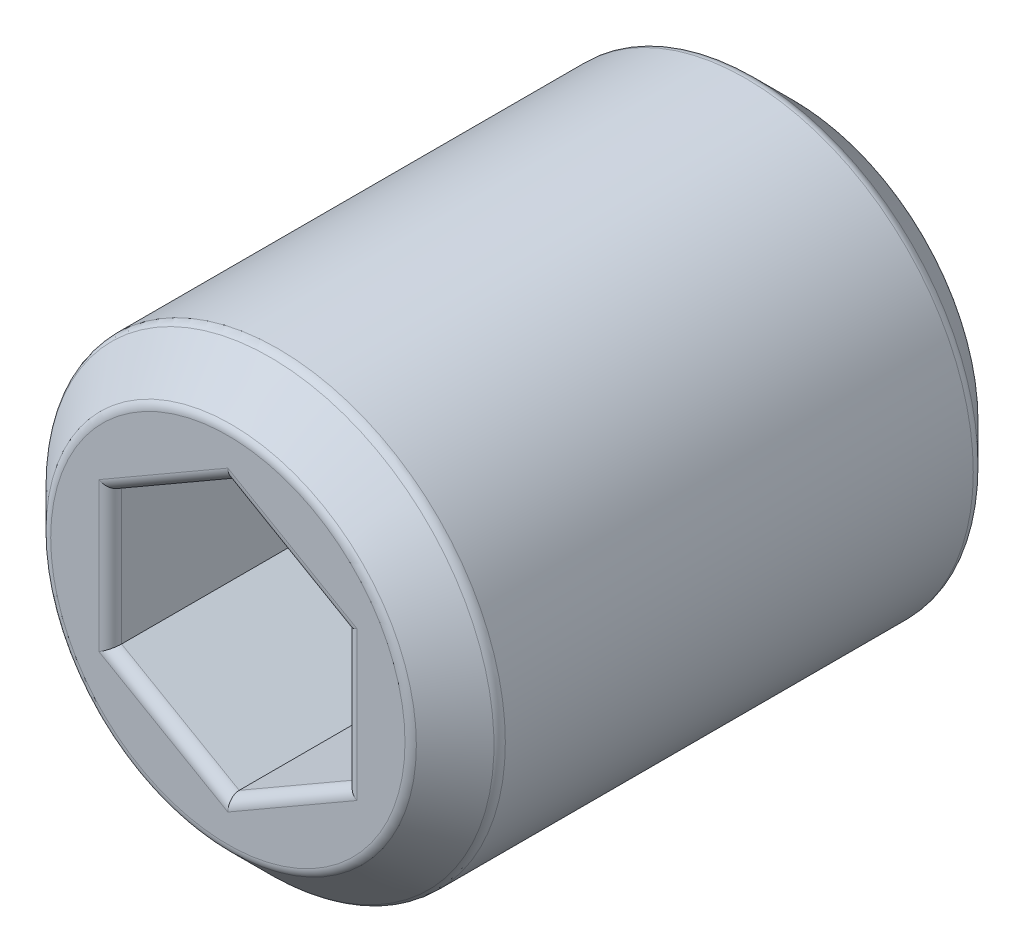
ISO-10303-21;
HEADER;
FILE_DESCRIPTION(('STEP AP214'),'2;1');
FILE_NAME('part.step','',(''),(''),'','','');
FILE_SCHEMA(('AUTOMOTIVE_DESIGN { 1 0 10303 214 1 1 1 1 }'));
ENDSEC;
DATA;
#1=APPLICATION_CONTEXT('core data for automotive mechanical design processes');
#2=APPLICATION_PROTOCOL_DEFINITION('international standard','automotive_design',2000,#1);
#3=PRODUCT_CONTEXT('',#1,'mechanical');
#4=PRODUCT('Part','Part','',(#3));
#5=PRODUCT_RELATED_PRODUCT_CATEGORY('part','',(#4));
#6=PRODUCT_DEFINITION_FORMATION('','',#4);
#7=PRODUCT_DEFINITION_CONTEXT('part definition',#1,'design');
#8=PRODUCT_DEFINITION('design','',#6,#7);
#9=PRODUCT_DEFINITION_SHAPE('','',#8);
#10=(LENGTH_UNIT() NAMED_UNIT(*) SI_UNIT(.MILLI.,.METRE.));
#11=(NAMED_UNIT(*) PLANE_ANGLE_UNIT() SI_UNIT($,.RADIAN.));
#12=(NAMED_UNIT(*) SI_UNIT($,.STERADIAN.) SOLID_ANGLE_UNIT());
#13=UNCERTAINTY_MEASURE_WITH_UNIT(LENGTH_MEASURE(1.E-05),#10,'distance_accuracy_value','');
#14=(GEOMETRIC_REPRESENTATION_CONTEXT(3) GLOBAL_UNCERTAINTY_ASSIGNED_CONTEXT((#13)) GLOBAL_UNIT_ASSIGNED_CONTEXT((#10,
#11,#12)) REPRESENTATION_CONTEXT('',''));
#15=CARTESIAN_POINT('',(0.,0.,0.));
#16=DIRECTION('',(0.,0.,1.));
#17=DIRECTION('',(1.,0.,0.));
#18=AXIS2_PLACEMENT_3D('',#15,#16,#17);
#19=CARTESIAN_POINT('',(0.,0.,5.));
#20=DIRECTION('',(0.,0.,-1.));
#21=DIRECTION('',(-1.,0.,0.));
#22=AXIS2_PLACEMENT_3D('',#19,#20,#21);
#23=CYLINDRICAL_SURFACE('',#22,2.);
#24=CARTESIAN_POINT('',(0.,0.,4.55857864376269));
#25=DIRECTION('',(0.,0.,1.));
#26=DIRECTION('',(1.,0.,0.));
#27=AXIS2_PLACEMENT_3D('',#24,#25,#26);
#28=CIRCLE('',#27,2.);
#29=CARTESIAN_POINT('',(2.,0.,4.55857864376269));
#30=VERTEX_POINT('',#29);
#31=EDGE_CURVE('E11',#30,#30,#28,.F.);
#32=ORIENTED_EDGE('',*,*,#31,.T.);
#33=EDGE_LOOP('',(#32));
#34=FACE_BOUND('',#33,.T.);
#35=CARTESIAN_POINT('',(0.,0.,0.44142135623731));
#36=DIRECTION('',(0.,0.,-1.));
#37=DIRECTION('',(-1.,0.,0.));
#38=AXIS2_PLACEMENT_3D('',#35,#36,#37);
#39=CIRCLE('',#38,2.);
#40=CARTESIAN_POINT('',(-2.,0.,0.44142135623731));
#41=VERTEX_POINT('',#40);
#42=EDGE_CURVE('E39',#41,#41,#39,.F.);
#43=ORIENTED_EDGE('',*,*,#42,.T.);
#44=EDGE_LOOP('',(#43));
#45=FACE_BOUND('',#44,.T.);
#46=ADVANCED_FACE('F32',(#34,#45),#23,.T.);
#47=CARTESIAN_POINT('',(0.,0.,5.));
#48=DIRECTION('',(0.,0.,1.));
#49=DIRECTION('',(1.,0.,0.));
#50=AXIS2_PLACEMENT_3D('',#47,#48,#49);
#51=PLANE('',#50);
#52=CARTESIAN_POINT('',(0.,0.,5.));
#53=DIRECTION('',(0.,0.,1.));
#54=DIRECTION('',(1.,0.,0.));
#55=AXIS2_PLACEMENT_3D('',#52,#53,#54);
#56=CIRCLE('',#55,1.55857864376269);
#57=CARTESIAN_POINT('',(1.55857864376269,0.,5.));
#58=VERTEX_POINT('',#57);
#59=EDGE_CURVE('E175',#58,#58,#56,.T.);
#60=ORIENTED_EDGE('',*,*,#59,.T.);
#61=EDGE_LOOP('',(#60));
#62=FACE_BOUND('',#61,.T.);
#63=DIRECTION('',(0.,-1.,0.));
#64=VECTOR('',#63,1.);
#65=CARTESIAN_POINT('',(-1.13481522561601,0.597450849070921,5.));
#66=LINE('',#65,#64);
#67=CARTESIAN_POINT('',(-1.134815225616,-0.655185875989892,5.));
#68=VERTEX_POINT('',#67);
#69=CARTESIAN_POINT('',(-1.13481522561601,0.655185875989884,5.));
#70=VERTEX_POINT('',#69);
#71=EDGE_CURVE('E170',#68,#70,#66,.F.);
#72=ORIENTED_EDGE('',*,*,#71,.T.);
#73=DIRECTION('',(-0.866025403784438,-0.500000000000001,0.));
#74=VECTOR('',#73,1.);
#75=CARTESIAN_POINT('',(-0.0500000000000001,1.28150423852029,5.));
#76=LINE('',#75,#74);
#77=CARTESIAN_POINT('',(0.,1.31037175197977,5.));
#78=VERTEX_POINT('',#77);
#79=EDGE_CURVE('E172',#70,#78,#76,.F.);
#80=ORIENTED_EDGE('',*,*,#79,.T.);
#81=DIRECTION('',(-0.866025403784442,0.499999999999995,0.));
#82=VECTOR('',#81,1.);
#83=CARTESIAN_POINT('',(1.084815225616,0.68405338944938,5.));
#84=LINE('',#83,#82);
#85=CARTESIAN_POINT('',(1.134815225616,0.655185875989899,5.));
#86=VERTEX_POINT('',#85);
#87=EDGE_CURVE('E162',#78,#86,#84,.F.);
#88=ORIENTED_EDGE('',*,*,#87,.T.);
#89=DIRECTION('',(0.,1.,0.));
#90=VECTOR('',#89,1.);
#91=CARTESIAN_POINT('',(1.13481522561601,-0.597450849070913,5.));
#92=LINE('',#91,#90);
#93=CARTESIAN_POINT('',(1.13481522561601,-0.655185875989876,5.));
#94=VERTEX_POINT('',#93);
#95=EDGE_CURVE('E164',#86,#94,#92,.F.);
#96=ORIENTED_EDGE('',*,*,#95,.T.);
#97=DIRECTION('',(0.866025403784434,0.500000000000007,0.));
#98=VECTOR('',#97,1.);
#99=CARTESIAN_POINT('',(0.0500000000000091,-1.28150423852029,5.));
#100=LINE('',#99,#98);
#101=CARTESIAN_POINT('',(0.,-1.31037175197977,5.));
#102=VERTEX_POINT('',#101);
#103=EDGE_CURVE('E166',#94,#102,#100,.F.);
#104=ORIENTED_EDGE('',*,*,#103,.T.);
#105=DIRECTION('',(0.866025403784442,-0.499999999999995,0.));
#106=VECTOR('',#105,1.);
#107=CARTESIAN_POINT('',(-1.084815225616,-0.684053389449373,5.));
#108=LINE('',#107,#106);
#109=EDGE_CURVE('E168',#102,#68,#108,.F.);
#110=ORIENTED_EDGE('',*,*,#109,.T.);
#111=EDGE_LOOP('',(#72,#80,#88,#96,#104,#110));
#112=FACE_BOUND('',#111,.T.);
#113=ADVANCED_FACE('F209',(#62,#112),#51,.T.);
#114=CARTESIAN_POINT('',(0.,0.,0.));
#115=DIRECTION('',(0.,0.,1.));
#116=DIRECTION('',(1.,0.,0.));
#117=AXIS2_PLACEMENT_3D('',#114,#115,#116);
#118=PLANE('',#117);
#119=CARTESIAN_POINT('',(0.,0.,0.));
#120=DIRECTION('',(0.,0.,1.));
#121=DIRECTION('',(1.,0.,0.));
#122=AXIS2_PLACEMENT_3D('',#119,#120,#121);
#123=CIRCLE('',#122,1.55857864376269);
#124=CARTESIAN_POINT('',(1.55857864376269,0.,0.));
#125=VERTEX_POINT('',#124);
#126=EDGE_CURVE('E145',#125,#125,#123,.F.);
#127=ORIENTED_EDGE('',*,*,#126,.T.);
#128=EDGE_LOOP('',(#127));
#129=FACE_BOUND('',#128,.T.);
#130=ADVANCED_FACE('F214',(#129),#118,.F.);
#131=CARTESIAN_POINT('',(0.,0.,0.4));
#132=DIRECTION('',(0.,0.,1.));
#133=DIRECTION('',(1.,0.,0.));
#134=AXIS2_PLACEMENT_3D('',#131,#132,#133);
#135=CONICAL_SURFACE('',#134,2.,0.78539816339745);
#136=CARTESIAN_POINT('',(0.,0.,0.029289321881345));
#137=DIRECTION('',(0.,0.,1.));
#138=DIRECTION('',(1.,0.,0.));
#139=AXIS2_PLACEMENT_3D('',#136,#137,#138);
#140=CIRCLE('',#139,1.62928932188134);
#141=CARTESIAN_POINT('',(1.62928932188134,0.,0.029289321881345));
#142=VERTEX_POINT('',#141);
#143=EDGE_CURVE('E159',#142,#142,#140,.T.);
#144=ORIENTED_EDGE('',*,*,#143,.T.);
#145=EDGE_LOOP('',(#144));
#146=FACE_BOUND('',#145,.T.);
#147=CARTESIAN_POINT('',(0.,0.,0.370710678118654));
#148=DIRECTION('',(0.,0.,1.));
#149=DIRECTION('',(1.,0.,0.));
#150=AXIS2_PLACEMENT_3D('',#147,#148,#149);
#151=CIRCLE('',#150,1.97071067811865);
#152=CARTESIAN_POINT('',(1.97071067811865,0.,0.370710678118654));
#153=VERTEX_POINT('',#152);
#154=EDGE_CURVE('E156',#153,#153,#151,.F.);
#155=ORIENTED_EDGE('',*,*,#154,.T.);
#156=EDGE_LOOP('',(#155));
#157=FACE_BOUND('',#156,.T.);
#158=ADVANCED_FACE('F221',(#146,#157),#135,.T.);
#159=CARTESIAN_POINT('',(0.,0.,5.));
#160=DIRECTION('',(0.,0.,-1.));
#161=DIRECTION('',(-1.,0.,0.));
#162=AXIS2_PLACEMENT_3D('',#159,#160,#161);
#163=CONICAL_SURFACE('',#162,1.6,0.785398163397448);
#164=CARTESIAN_POINT('',(0.,0.,4.97071067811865));
#165=DIRECTION('',(0.,0.,1.));
#166=DIRECTION('',(1.,0.,0.));
#167=AXIS2_PLACEMENT_3D('',#164,#165,#166);
#168=CIRCLE('',#167,1.62928932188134);
#169=CARTESIAN_POINT('',(1.62928932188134,0.,4.97071067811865));
#170=VERTEX_POINT('',#169);
#171=EDGE_CURVE('E181',#170,#170,#168,.F.);
#172=ORIENTED_EDGE('',*,*,#171,.T.);
#173=EDGE_LOOP('',(#172));
#174=FACE_BOUND('',#173,.T.);
#175=CARTESIAN_POINT('',(0.,0.,4.62928932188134));
#176=DIRECTION('',(0.,0.,-1.));
#177=DIRECTION('',(-1.,0.,0.));
#178=AXIS2_PLACEMENT_3D('',#175,#176,#177);
#179=CIRCLE('',#178,1.97071067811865);
#180=CARTESIAN_POINT('',(-1.97071067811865,0.,4.62928932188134));
#181=VERTEX_POINT('',#180);
#182=EDGE_CURVE('E178',#181,#181,#179,.F.);
#183=ORIENTED_EDGE('',*,*,#182,.T.);
#184=EDGE_LOOP('',(#183));
#185=FACE_BOUND('',#184,.T.);
#186=ADVANCED_FACE('F228',(#174,#185),#163,.T.);
#187=CARTESIAN_POINT('',(1.034815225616,0.597450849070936,3.));
#188=DIRECTION('',(0.499999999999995,0.866025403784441,0.));
#189=DIRECTION('',(-0.866025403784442,0.499999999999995,0.));
#190=AXIS2_PLACEMENT_3D('',#187,#188,#189);
#191=PLANE('',#190);
#192=DIRECTION('',(0.,0.,1.));
#193=VECTOR('',#192,1.);
#194=CARTESIAN_POINT('',(1.034815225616,0.597450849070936,3.));
#195=LINE('',#194,#193);
#196=CARTESIAN_POINT('',(1.034815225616,0.597450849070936,3.));
#197=VERTEX_POINT('',#196);
#198=CARTESIAN_POINT('',(1.034815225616,0.597450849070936,4.9));
#199=VERTEX_POINT('',#198);
#200=EDGE_CURVE('E143',#197,#199,#195,.T.);
#201=ORIENTED_EDGE('',*,*,#200,.T.);
#202=DIRECTION('',(-0.866025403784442,0.499999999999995,0.));
#203=VECTOR('',#202,1.);
#204=CARTESIAN_POINT('',(0.,1.19490169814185,4.9));
#205=LINE('',#204,#203);
#206=CARTESIAN_POINT('',(0.,1.19490169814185,4.9));
#207=VERTEX_POINT('',#206);
#208=EDGE_CURVE('E110',#199,#207,#205,.T.);
#209=ORIENTED_EDGE('',*,*,#208,.T.);
#210=DIRECTION('',(0.,0.,1.));
#211=VECTOR('',#210,1.);
#212=CARTESIAN_POINT('',(0.,1.19490169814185,3.));
#213=LINE('',#212,#211);
#214=CARTESIAN_POINT('',(0.,1.19490169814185,3.));
#215=VERTEX_POINT('',#214);
#216=EDGE_CURVE('E103',#215,#207,#213,.T.);
#217=ORIENTED_EDGE('',*,*,#216,.F.);
#218=DIRECTION('',(-0.866025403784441,0.499999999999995,0.));
#219=VECTOR('',#218,1.);
#220=CARTESIAN_POINT('',(1.034815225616,0.597450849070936,3.));
#221=LINE('',#220,#219);
#222=EDGE_CURVE('E107',#197,#215,#221,.T.);
#223=ORIENTED_EDGE('',*,*,#222,.F.);
#224=EDGE_LOOP('',(#201,#209,#217,#223));
#225=FACE_BOUND('',#224,.T.);
#226=ADVANCED_FACE('F105',(#225),#191,.F.);
#227=CARTESIAN_POINT('',(1.03481522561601,-0.597450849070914,3.));
#228=DIRECTION('',(1.,0.,0.));
#229=DIRECTION('',(0.,1.,0.));
#230=AXIS2_PLACEMENT_3D('',#227,#228,#229);
#231=PLANE('',#230);
#232=DIRECTION('',(0.,0.,1.));
#233=VECTOR('',#232,1.);
#234=CARTESIAN_POINT('',(1.03481522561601,-0.597450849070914,3.));
#235=LINE('',#234,#233);
#236=CARTESIAN_POINT('',(1.03481522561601,-0.597450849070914,3.));
#237=VERTEX_POINT('',#236);
#238=CARTESIAN_POINT('',(1.03481522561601,-0.597450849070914,4.9));
#239=VERTEX_POINT('',#238);
#240=EDGE_CURVE('E146',#237,#239,#235,.T.);
#241=ORIENTED_EDGE('',*,*,#240,.T.);
#242=DIRECTION('',(0.,1.,0.));
#243=VECTOR('',#242,1.);
#244=CARTESIAN_POINT('',(1.034815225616,0.597450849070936,4.9));
#245=LINE('',#244,#243);
#246=EDGE_CURVE('E46',#239,#199,#245,.T.);
#247=ORIENTED_EDGE('',*,*,#246,.T.);
#248=ORIENTED_EDGE('',*,*,#200,.F.);
#249=DIRECTION('',(0.,1.,0.));
#250=VECTOR('',#249,1.);
#251=CARTESIAN_POINT('',(1.03481522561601,-0.597450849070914,3.));
#252=LINE('',#251,#250);
#253=EDGE_CURVE('E115',#237,#197,#252,.T.);
#254=ORIENTED_EDGE('',*,*,#253,.F.);
#255=EDGE_LOOP('',(#241,#247,#248,#254));
#256=FACE_BOUND('',#255,.T.);
#257=ADVANCED_FACE('F235',(#256),#231,.F.);
#258=CARTESIAN_POINT('',(0.,-1.19490169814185,3.));
#259=DIRECTION('',(0.500000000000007,-0.866025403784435,0.));
#260=DIRECTION('',(0.866025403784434,0.500000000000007,0.));
#261=AXIS2_PLACEMENT_3D('',#258,#259,#260);
#262=PLANE('',#261);
#263=DIRECTION('',(0.,0.,1.));
#264=VECTOR('',#263,1.);
#265=CARTESIAN_POINT('',(0.,-1.19490169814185,3.));
#266=LINE('',#265,#264);
#267=CARTESIAN_POINT('',(0.,-1.19490169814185,3.));
#268=VERTEX_POINT('',#267);
#269=CARTESIAN_POINT('',(0.,-1.19490169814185,4.9));
#270=VERTEX_POINT('',#269);
#271=EDGE_CURVE('E148',#268,#270,#266,.T.);
#272=ORIENTED_EDGE('',*,*,#271,.T.);
#273=DIRECTION('',(0.866025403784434,0.500000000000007,0.));
#274=VECTOR('',#273,1.);
#275=CARTESIAN_POINT('',(1.03481522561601,-0.597450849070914,4.9));
#276=LINE('',#275,#274);
#277=EDGE_CURVE('E54',#270,#239,#276,.T.);
#278=ORIENTED_EDGE('',*,*,#277,.T.);
#279=ORIENTED_EDGE('',*,*,#240,.F.);
#280=DIRECTION('',(0.866025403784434,0.500000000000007,0.));
#281=VECTOR('',#280,1.);
#282=CARTESIAN_POINT('',(0.,-1.19490169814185,3.));
#283=LINE('',#282,#281);
#284=EDGE_CURVE('E140',#268,#237,#283,.T.);
#285=ORIENTED_EDGE('',*,*,#284,.F.);
#286=EDGE_LOOP('',(#272,#278,#279,#285));
#287=FACE_BOUND('',#286,.T.);
#288=ADVANCED_FACE('F245',(#287),#262,.F.);
#289=CARTESIAN_POINT('',(-1.034815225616,-0.597450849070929,3.));
#290=DIRECTION('',(-0.499999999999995,-0.866025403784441,0.));
#291=DIRECTION('',(0.866025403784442,-0.499999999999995,0.));
#292=AXIS2_PLACEMENT_3D('',#289,#290,#291);
#293=PLANE('',#292);
#294=DIRECTION('',(0.,0.,1.));
#295=VECTOR('',#294,1.);
#296=CARTESIAN_POINT('',(-1.034815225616,-0.597450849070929,3.));
#297=LINE('',#296,#295);
#298=CARTESIAN_POINT('',(-1.034815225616,-0.597450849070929,3.));
#299=VERTEX_POINT('',#298);
#300=CARTESIAN_POINT('',(-1.034815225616,-0.597450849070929,4.9));
#301=VERTEX_POINT('',#300);
#302=EDGE_CURVE('E150',#299,#301,#297,.T.);
#303=ORIENTED_EDGE('',*,*,#302,.T.);
#304=DIRECTION('',(0.866025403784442,-0.499999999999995,0.));
#305=VECTOR('',#304,1.);
#306=CARTESIAN_POINT('',(0.,-1.19490169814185,4.9));
#307=LINE('',#306,#305);
#308=EDGE_CURVE('E188',#301,#270,#307,.T.);
#309=ORIENTED_EDGE('',*,*,#308,.T.);
#310=ORIENTED_EDGE('',*,*,#271,.F.);
#311=DIRECTION('',(0.866025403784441,-0.499999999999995,0.));
#312=VECTOR('',#311,1.);
#313=CARTESIAN_POINT('',(-1.034815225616,-0.597450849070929,3.));
#314=LINE('',#313,#312);
#315=EDGE_CURVE('E137',#299,#268,#314,.T.);
#316=ORIENTED_EDGE('',*,*,#315,.F.);
#317=EDGE_LOOP('',(#303,#309,#310,#316));
#318=FACE_BOUND('',#317,.T.);
#319=ADVANCED_FACE('F241',(#318),#293,.F.);
#320=CARTESIAN_POINT('',(-1.03481522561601,0.597450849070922,3.));
#321=DIRECTION('',(-1.,0.,0.));
#322=DIRECTION('',(0.,-1.,0.));
#323=AXIS2_PLACEMENT_3D('',#320,#321,#322);
#324=PLANE('',#323);
#325=DIRECTION('',(0.,0.,1.));
#326=VECTOR('',#325,1.);
#327=CARTESIAN_POINT('',(-1.03481522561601,0.597450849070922,3.));
#328=LINE('',#327,#326);
#329=CARTESIAN_POINT('',(-1.03481522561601,0.597450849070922,3.));
#330=VERTEX_POINT('',#329);
#331=CARTESIAN_POINT('',(-1.03481522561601,0.597450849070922,4.9));
#332=VERTEX_POINT('',#331);
#333=EDGE_CURVE('E114',#330,#332,#328,.T.);
#334=ORIENTED_EDGE('',*,*,#333,.T.);
#335=DIRECTION('',(0.,-1.,0.));
#336=VECTOR('',#335,1.);
#337=CARTESIAN_POINT('',(-1.034815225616,-0.597450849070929,4.9));
#338=LINE('',#337,#336);
#339=EDGE_CURVE('E186',#332,#301,#338,.T.);
#340=ORIENTED_EDGE('',*,*,#339,.T.);
#341=ORIENTED_EDGE('',*,*,#302,.F.);
#342=DIRECTION('',(0.,-1.,0.));
#343=VECTOR('',#342,1.);
#344=CARTESIAN_POINT('',(-1.03481522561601,0.597450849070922,3.));
#345=LINE('',#344,#343);
#346=EDGE_CURVE('E124',#330,#299,#345,.T.);
#347=ORIENTED_EDGE('',*,*,#346,.F.);
#348=EDGE_LOOP('',(#334,#340,#341,#347));
#349=FACE_BOUND('',#348,.T.);
#350=ADVANCED_FACE('F238',(#349),#324,.F.);
#351=CARTESIAN_POINT('',(0.,1.19490169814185,3.));
#352=DIRECTION('',(-0.500000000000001,0.866025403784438,0.));
#353=DIRECTION('',(-0.866025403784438,-0.500000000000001,0.));
#354=AXIS2_PLACEMENT_3D('',#351,#352,#353);
#355=PLANE('',#354);
#356=ORIENTED_EDGE('',*,*,#216,.T.);
#357=DIRECTION('',(-0.866025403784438,-0.500000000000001,0.));
#358=VECTOR('',#357,1.);
#359=CARTESIAN_POINT('',(-1.03481522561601,0.597450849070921,4.9));
#360=LINE('',#359,#358);
#361=EDGE_CURVE('E184',#207,#332,#360,.T.);
#362=ORIENTED_EDGE('',*,*,#361,.T.);
#363=ORIENTED_EDGE('',*,*,#333,.F.);
#364=DIRECTION('',(-0.866025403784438,-0.500000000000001,0.));
#365=VECTOR('',#364,1.);
#366=CARTESIAN_POINT('',(0.,1.19490169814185,3.));
#367=LINE('',#366,#365);
#368=EDGE_CURVE('E118',#215,#330,#367,.T.);
#369=ORIENTED_EDGE('',*,*,#368,.F.);
#370=EDGE_LOOP('',(#356,#362,#363,#369));
#371=FACE_BOUND('',#370,.T.);
#372=ADVANCED_FACE('F119',(#371),#355,.F.);
#373=CARTESIAN_POINT('',(2.06963045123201,0.,3.));
#374=DIRECTION('',(0.,0.,-1.));
#375=DIRECTION('',(-1.,0.,0.));
#376=AXIS2_PLACEMENT_3D('',#373,#374,#375);
#377=PLANE('',#376);
#378=ORIENTED_EDGE('',*,*,#222,.T.);
#379=ORIENTED_EDGE('',*,*,#368,.T.);
#380=ORIENTED_EDGE('',*,*,#346,.T.);
#381=ORIENTED_EDGE('',*,*,#315,.T.);
#382=ORIENTED_EDGE('',*,*,#284,.T.);
#383=ORIENTED_EDGE('',*,*,#253,.T.);
#384=EDGE_LOOP('',(#378,#379,#380,#381,#382,#383));
#385=FACE_BOUND('',#384,.T.);
#386=ADVANCED_FACE('F126',(#385),#377,.F.);
#387=CARTESIAN_POINT('',(0.,0.,0.1));
#388=DIRECTION('',(0.,0.,1.));
#389=DIRECTION('',(1.,0.,0.));
#390=AXIS2_PLACEMENT_3D('',#387,#388,#389);
#391=TOROIDAL_SURFACE('',#390,1.55857864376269,0.1);
#392=ORIENTED_EDGE('',*,*,#143,.F.);
#393=EDGE_LOOP('',(#392));
#394=FACE_BOUND('',#393,.T.);
#395=ORIENTED_EDGE('',*,*,#126,.F.);
#396=EDGE_LOOP('',(#395));
#397=FACE_BOUND('',#396,.T.);
#398=ADVANCED_FACE('F253',(#394,#397),#391,.T.);
#399=CARTESIAN_POINT('',(0.,0.,4.9));
#400=DIRECTION('',(0.,0.,1.));
#401=DIRECTION('',(1.,0.,0.));
#402=AXIS2_PLACEMENT_3D('',#399,#400,#401);
#403=TOROIDAL_SURFACE('',#402,1.55857864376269,0.1);
#404=ORIENTED_EDGE('',*,*,#171,.F.);
#405=EDGE_LOOP('',(#404));
#406=FACE_BOUND('',#405,.T.);
#407=ORIENTED_EDGE('',*,*,#59,.F.);
#408=EDGE_LOOP('',(#407));
#409=FACE_BOUND('',#408,.T.);
#410=ADVANCED_FACE('F256',(#406,#409),#403,.T.);
#411=CARTESIAN_POINT('',(0.0500000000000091,-1.28150423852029,4.9));
#412=DIRECTION('',(-0.866025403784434,-0.500000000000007,0.));
#413=DIRECTION('',(0.500000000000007,-0.866025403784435,0.));
#414=AXIS2_PLACEMENT_3D('',#411,#412,#413);
#415=CYLINDRICAL_SURFACE('',#414,0.1);
#416=CARTESIAN_POINT('',(0.,-1.31037175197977,4.9));
#417=DIRECTION('',(-1.,0.,0.));
#418=DIRECTION('',(0.,1.,0.));
#419=AXIS2_PLACEMENT_3D('',#416,#417,#418);
#420=ELLIPSE('',#419,0.115470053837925,0.1);
#421=EDGE_CURVE('E132',#102,#270,#420,.T.);
#422=ORIENTED_EDGE('',*,*,#421,.F.);
#423=ORIENTED_EDGE('',*,*,#103,.F.);
#424=CARTESIAN_POINT('',(1.13481522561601,-0.655185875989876,4.9));
#425=DIRECTION('',(-0.499999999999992,-0.866025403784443,0.));
#426=DIRECTION('',(-0.866025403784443,0.499999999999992,0.));
#427=AXIS2_PLACEMENT_3D('',#424,#425,#426);
#428=ELLIPSE('',#427,0.115470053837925,0.1);
#429=EDGE_CURVE('E129',#239,#94,#428,.F.);
#430=ORIENTED_EDGE('',*,*,#429,.F.);
#431=ORIENTED_EDGE('',*,*,#277,.F.);
#432=EDGE_LOOP('',(#422,#423,#430,#431));
#433=FACE_BOUND('',#432,.T.);
#434=ADVANCED_FACE('F260',(#433),#415,.T.);
#435=CARTESIAN_POINT('',(1.13481522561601,-0.597450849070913,4.9));
#436=DIRECTION('',(0.,-1.,0.));
#437=DIRECTION('',(1.,0.,0.));
#438=AXIS2_PLACEMENT_3D('',#435,#436,#437);
#439=CYLINDRICAL_SURFACE('',#438,0.1);
#440=ORIENTED_EDGE('',*,*,#429,.T.);
#441=ORIENTED_EDGE('',*,*,#95,.F.);
#442=CARTESIAN_POINT('',(1.134815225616,0.655185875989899,4.9));
#443=DIRECTION('',(0.500000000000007,-0.866025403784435,0.));
#444=DIRECTION('',(-0.866025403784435,-0.500000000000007,0.));
#445=AXIS2_PLACEMENT_3D('',#442,#443,#444);
#446=ELLIPSE('',#445,0.115470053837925,0.1);
#447=EDGE_CURVE('E295',#199,#86,#446,.F.);
#448=ORIENTED_EDGE('',*,*,#447,.F.);
#449=ORIENTED_EDGE('',*,*,#246,.F.);
#450=EDGE_LOOP('',(#440,#441,#448,#449));
#451=FACE_BOUND('',#450,.T.);
#452=ADVANCED_FACE('F264',(#451),#439,.T.);
#453=CARTESIAN_POINT('',(-1.084815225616,-0.684053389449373,4.9));
#454=DIRECTION('',(-0.866025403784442,0.499999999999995,0.));
#455=DIRECTION('',(-0.499999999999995,-0.866025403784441,0.));
#456=AXIS2_PLACEMENT_3D('',#453,#454,#455);
#457=CYLINDRICAL_SURFACE('',#456,0.1);
#458=ORIENTED_EDGE('',*,*,#421,.T.);
#459=ORIENTED_EDGE('',*,*,#308,.F.);
#460=CARTESIAN_POINT('',(-1.134815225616,-0.655185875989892,4.9));
#461=DIRECTION('',(-0.500000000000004,0.866025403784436,0.));
#462=DIRECTION('',(0.866025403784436,0.500000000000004,0.));
#463=AXIS2_PLACEMENT_3D('',#460,#461,#462);
#464=ELLIPSE('',#463,0.115470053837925,0.1);
#465=EDGE_CURVE('E290',#68,#301,#464,.T.);
#466=ORIENTED_EDGE('',*,*,#465,.F.);
#467=ORIENTED_EDGE('',*,*,#109,.F.);
#468=EDGE_LOOP('',(#458,#459,#466,#467));
#469=FACE_BOUND('',#468,.T.);
#470=ADVANCED_FACE('F268',(#469),#457,.T.);
#471=CARTESIAN_POINT('',(1.084815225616,0.68405338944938,4.9));
#472=DIRECTION('',(0.866025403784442,-0.499999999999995,0.));
#473=DIRECTION('',(0.499999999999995,0.866025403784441,0.));
#474=AXIS2_PLACEMENT_3D('',#471,#472,#473);
#475=CYLINDRICAL_SURFACE('',#474,0.1);
#476=ORIENTED_EDGE('',*,*,#447,.T.);
#477=ORIENTED_EDGE('',*,*,#87,.F.);
#478=CARTESIAN_POINT('',(0.,1.31037175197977,4.9));
#479=DIRECTION('',(1.,0.,0.));
#480=DIRECTION('',(0.,1.,0.));
#481=AXIS2_PLACEMENT_3D('',#478,#479,#480);
#482=ELLIPSE('',#481,0.115470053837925,0.1);
#483=EDGE_CURVE('E287',#207,#78,#482,.F.);
#484=ORIENTED_EDGE('',*,*,#483,.F.);
#485=ORIENTED_EDGE('',*,*,#208,.F.);
#486=EDGE_LOOP('',(#476,#477,#484,#485));
#487=FACE_BOUND('',#486,.T.);
#488=ADVANCED_FACE('F272',(#487),#475,.T.);
#489=CARTESIAN_POINT('',(-1.13481522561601,0.597450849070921,4.9));
#490=DIRECTION('',(0.,1.,0.));
#491=DIRECTION('',(-1.,0.,0.));
#492=AXIS2_PLACEMENT_3D('',#489,#490,#491);
#493=CYLINDRICAL_SURFACE('',#492,0.1);
#494=ORIENTED_EDGE('',*,*,#465,.T.);
#495=ORIENTED_EDGE('',*,*,#339,.F.);
#496=CARTESIAN_POINT('',(-1.13481522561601,0.655185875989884,4.9));
#497=DIRECTION('',(0.499999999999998,0.86602540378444,0.));
#498=DIRECTION('',(0.86602540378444,-0.499999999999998,0.));
#499=AXIS2_PLACEMENT_3D('',#496,#497,#498);
#500=ELLIPSE('',#499,0.115470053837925,0.1);
#501=EDGE_CURVE('E291',#70,#332,#500,.T.);
#502=ORIENTED_EDGE('',*,*,#501,.F.);
#503=ORIENTED_EDGE('',*,*,#71,.F.);
#504=EDGE_LOOP('',(#494,#495,#502,#503));
#505=FACE_BOUND('',#504,.T.);
#506=ADVANCED_FACE('F276',(#505),#493,.T.);
#507=CARTESIAN_POINT('',(-0.0500000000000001,1.28150423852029,4.9));
#508=DIRECTION('',(0.866025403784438,0.500000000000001,0.));
#509=DIRECTION('',(-0.500000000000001,0.866025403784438,0.));
#510=AXIS2_PLACEMENT_3D('',#507,#508,#509);
#511=CYLINDRICAL_SURFACE('',#510,0.1);
#512=ORIENTED_EDGE('',*,*,#483,.T.);
#513=ORIENTED_EDGE('',*,*,#79,.F.);
#514=ORIENTED_EDGE('',*,*,#501,.T.);
#515=ORIENTED_EDGE('',*,*,#361,.F.);
#516=EDGE_LOOP('',(#512,#513,#514,#515));
#517=FACE_BOUND('',#516,.T.);
#518=ADVANCED_FACE('F204',(#517),#511,.T.);
#519=CARTESIAN_POINT('',(0.,0.,4.55857864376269));
#520=DIRECTION('',(0.,0.,1.));
#521=DIRECTION('',(1.,0.,0.));
#522=AXIS2_PLACEMENT_3D('',#519,#520,#521);
#523=TOROIDAL_SURFACE('',#522,1.9,0.1);
#524=ORIENTED_EDGE('',*,*,#182,.F.);
#525=EDGE_LOOP('',(#524));
#526=FACE_BOUND('',#525,.T.);
#527=ORIENTED_EDGE('',*,*,#31,.F.);
#528=EDGE_LOOP('',(#527));
#529=FACE_BOUND('',#528,.T.);
#530=ADVANCED_FACE('F198',(#526,#529),#523,.T.);
#531=CARTESIAN_POINT('',(0.,0.,0.44142135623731));
#532=DIRECTION('',(0.,0.,-1.));
#533=DIRECTION('',(-1.,0.,0.));
#534=AXIS2_PLACEMENT_3D('',#531,#532,#533);
#535=TOROIDAL_SURFACE('',#534,1.9,0.1);
#536=ORIENTED_EDGE('',*,*,#154,.F.);
#537=EDGE_LOOP('',(#536));
#538=FACE_BOUND('',#537,.T.);
#539=ORIENTED_EDGE('',*,*,#42,.F.);
#540=EDGE_LOOP('',(#539));
#541=FACE_BOUND('',#540,.T.);
#542=ADVANCED_FACE('F196',(#538,#541),#535,.T.);
#543=CLOSED_SHELL('',(#46,#113,#130,#158,#186,#226,#257,#288,#319,#350,#372,#386,#398,#410,#434,
#452,#470,#488,#506,#518,#530,#542));
#544=MANIFOLD_SOLID_BREP('B2',#543);
#545=ADVANCED_BREP_SHAPE_REPRESENTATION('',(#18,#544),#14);
#546=SHAPE_DEFINITION_REPRESENTATION(#9,#545);
ENDSEC;
END-ISO-10303-21;
